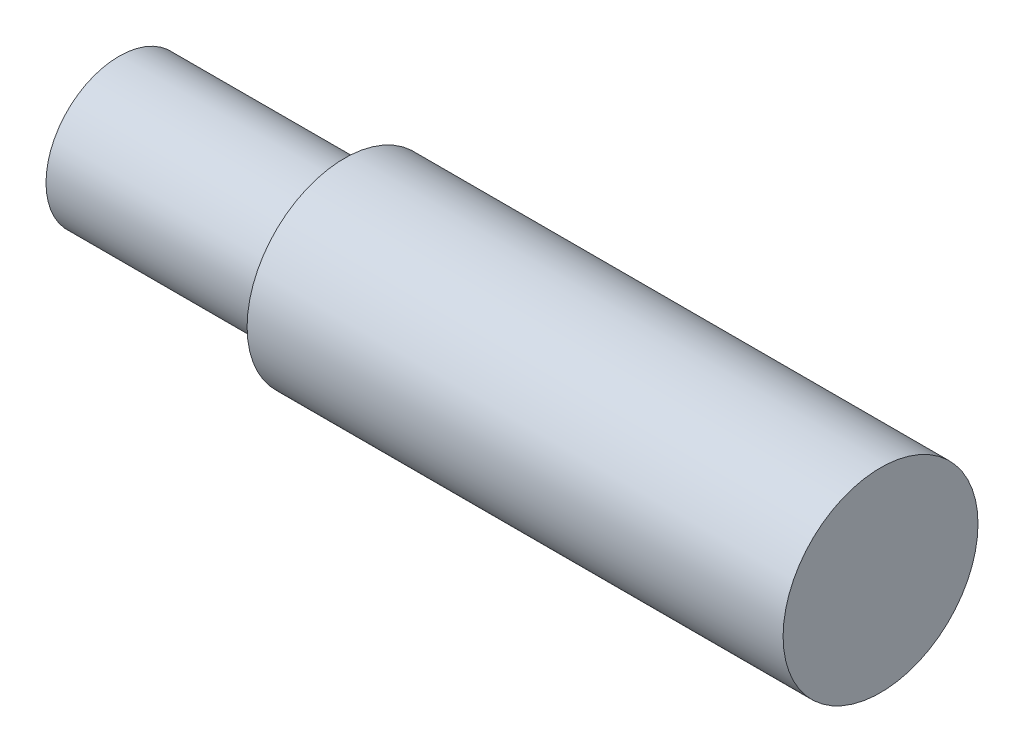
from build123d import *


with BuildPart() as part:
    # Sketch1 → Revolve1 (revolve)
    with BuildSketch(Plane(origin=(0, 0, 0), x_dir=(1, 0, 0), z_dir=(0, 1, 0)), mode=Mode.PRIVATE) as revolve1_sk:
        with BuildLine():
            Line((0, 0), (32, 0))
            Line((32, 0), (32, 4))
            Line((32, 4), (10, 4))
            Line((10, 4), (10, 3))
            Line((10, 3), (0.746511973, 3))
            ThreePointArc((0.746511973, 3), (0.18943087, 1.54574255), (0, 0))
        make_face()
    revolve(revolve1_sk.sketch.rotate(Axis((0, 0, 0), (1, 0, 0)), 180), axis=Axis((0, 0, 0), (1, 0, 0)))


solid = part.part
